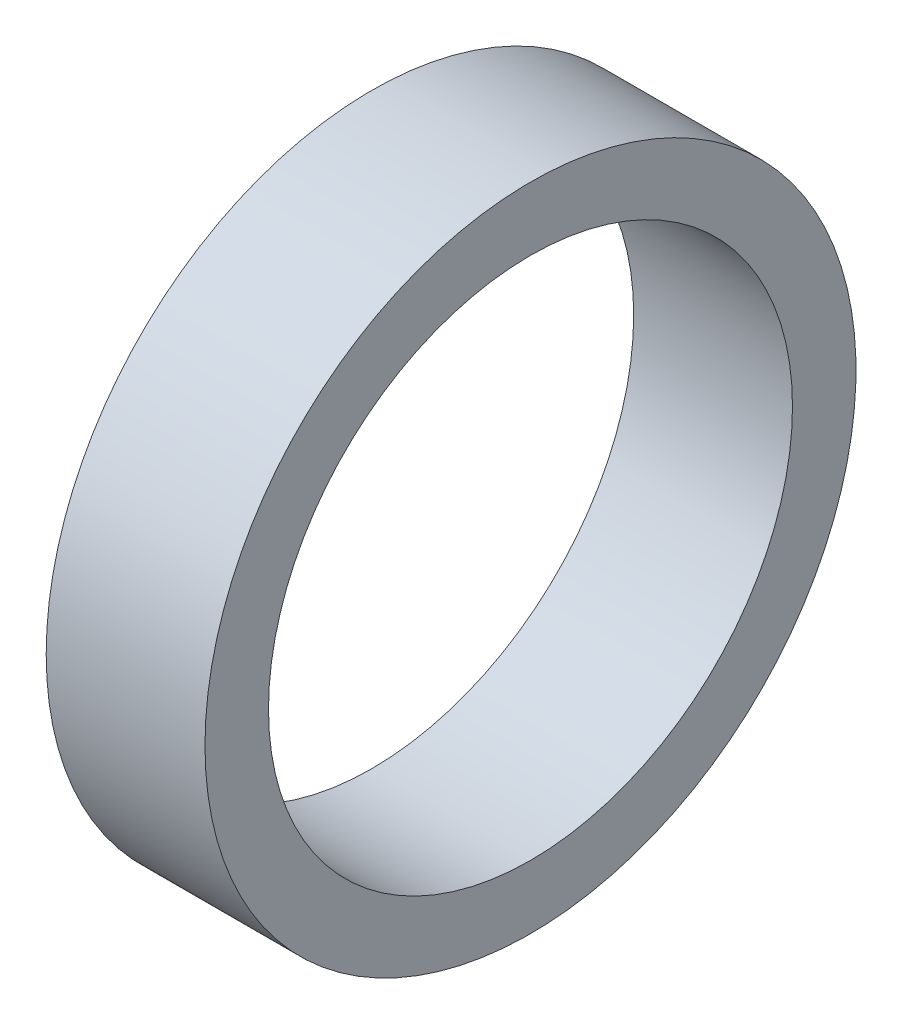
ISO-10303-21;
HEADER;
FILE_DESCRIPTION(('STEP AP214'),'2;1');
FILE_NAME('part.step','',(''),(''),'','','');
FILE_SCHEMA(('AUTOMOTIVE_DESIGN { 1 0 10303 214 1 1 1 1 }'));
ENDSEC;
DATA;
#1=APPLICATION_CONTEXT('core data for automotive mechanical design processes');
#2=APPLICATION_PROTOCOL_DEFINITION('international standard','automotive_design',2000,#1);
#3=PRODUCT_CONTEXT('',#1,'mechanical');
#4=PRODUCT('Part','Part','',(#3));
#5=PRODUCT_RELATED_PRODUCT_CATEGORY('part','',(#4));
#6=PRODUCT_DEFINITION_FORMATION('','',#4);
#7=PRODUCT_DEFINITION_CONTEXT('part definition',#1,'design');
#8=PRODUCT_DEFINITION('design','',#6,#7);
#9=PRODUCT_DEFINITION_SHAPE('','',#8);
#10=(LENGTH_UNIT() NAMED_UNIT(*) SI_UNIT(.MILLI.,.METRE.));
#11=(NAMED_UNIT(*) PLANE_ANGLE_UNIT() SI_UNIT($,.RADIAN.));
#12=(NAMED_UNIT(*) SI_UNIT($,.STERADIAN.) SOLID_ANGLE_UNIT());
#13=UNCERTAINTY_MEASURE_WITH_UNIT(LENGTH_MEASURE(1.E-05),#10,'distance_accuracy_value','');
#14=(GEOMETRIC_REPRESENTATION_CONTEXT(3) GLOBAL_UNCERTAINTY_ASSIGNED_CONTEXT((#13)) GLOBAL_UNIT_ASSIGNED_CONTEXT((#10,
#11,#12)) REPRESENTATION_CONTEXT('',''));
#15=CARTESIAN_POINT('',(0.,0.,0.));
#16=DIRECTION('',(0.,0.,1.));
#17=DIRECTION('',(1.,0.,0.));
#18=AXIS2_PLACEMENT_3D('',#15,#16,#17);
#19=CARTESIAN_POINT('',(-5.,20.5,0.));
#20=DIRECTION('',(1.,0.,0.));
#21=DIRECTION('',(0.,0.,-1.));
#22=AXIS2_PLACEMENT_3D('',#19,#20,#21);
#23=PLANE('',#22);
#24=CARTESIAN_POINT('',(-5.,0.,0.));
#25=DIRECTION('',(-1.,0.,0.));
#26=DIRECTION('',(0.,0.,1.));
#27=AXIS2_PLACEMENT_3D('',#24,#25,#26);
#28=CIRCLE('',#27,16.5);
#29=CARTESIAN_POINT('',(-5.,0.,16.5));
#30=VERTEX_POINT('',#29);
#31=EDGE_CURVE('E10',#30,#30,#28,.T.);
#32=ORIENTED_EDGE('',*,*,#31,.F.);
#33=EDGE_LOOP('',(#32));
#34=FACE_BOUND('',#33,.T.);
#35=CARTESIAN_POINT('',(-5.,0.,0.));
#36=DIRECTION('',(-1.,0.,0.));
#37=DIRECTION('',(0.,0.,1.));
#38=AXIS2_PLACEMENT_3D('',#35,#36,#37);
#39=CIRCLE('',#38,20.5);
#40=CARTESIAN_POINT('',(-5.,0.,20.5));
#41=VERTEX_POINT('',#40);
#42=EDGE_CURVE('E43',#41,#41,#39,.T.);
#43=ORIENTED_EDGE('',*,*,#42,.T.);
#44=EDGE_LOOP('',(#43));
#45=FACE_BOUND('',#44,.T.);
#46=ADVANCED_FACE('F29',(#34,#45),#23,.F.);
#47=CARTESIAN_POINT('',(-14.9039741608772,0.,0.));
#48=DIRECTION('',(-1.,0.,0.));
#49=DIRECTION('',(0.,0.,1.));
#50=AXIS2_PLACEMENT_3D('',#47,#48,#49);
#51=CYLINDRICAL_SURFACE('',#50,16.5);
#52=CARTESIAN_POINT('',(5.,0.,0.));
#53=DIRECTION('',(-1.,0.,0.));
#54=DIRECTION('',(0.,0.,1.));
#55=AXIS2_PLACEMENT_3D('',#52,#53,#54);
#56=CIRCLE('',#55,16.5);
#57=CARTESIAN_POINT('',(5.,0.,16.5));
#58=VERTEX_POINT('',#57);
#59=EDGE_CURVE('E35',#58,#58,#56,.T.);
#60=ORIENTED_EDGE('',*,*,#59,.F.);
#61=EDGE_LOOP('',(#60));
#62=FACE_BOUND('',#61,.T.);
#63=ORIENTED_EDGE('',*,*,#31,.T.);
#64=EDGE_LOOP('',(#63));
#65=FACE_BOUND('',#64,.T.);
#66=ADVANCED_FACE('F58',(#62,#65),#51,.F.);
#67=CARTESIAN_POINT('',(5.,20.5,0.));
#68=DIRECTION('',(-1.,0.,0.));
#69=DIRECTION('',(0.,0.,1.));
#70=AXIS2_PLACEMENT_3D('',#67,#68,#69);
#71=PLANE('',#70);
#72=CARTESIAN_POINT('',(5.,0.,0.));
#73=DIRECTION('',(-1.,0.,0.));
#74=DIRECTION('',(0.,0.,1.));
#75=AXIS2_PLACEMENT_3D('',#72,#73,#74);
#76=CIRCLE('',#75,20.5);
#77=CARTESIAN_POINT('',(5.,0.,20.5));
#78=VERTEX_POINT('',#77);
#79=EDGE_CURVE('E39',#78,#78,#76,.T.);
#80=ORIENTED_EDGE('',*,*,#79,.F.);
#81=EDGE_LOOP('',(#80));
#82=FACE_BOUND('',#81,.T.);
#83=ORIENTED_EDGE('',*,*,#59,.T.);
#84=EDGE_LOOP('',(#83));
#85=FACE_BOUND('',#84,.T.);
#86=ADVANCED_FACE('F53',(#82,#85),#71,.F.);
#87=CARTESIAN_POINT('',(-14.9039741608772,0.,0.));
#88=DIRECTION('',(-1.,0.,0.));
#89=DIRECTION('',(0.,0.,1.));
#90=AXIS2_PLACEMENT_3D('',#87,#88,#89);
#91=CYLINDRICAL_SURFACE('',#90,20.5);
#92=ORIENTED_EDGE('',*,*,#42,.F.);
#93=EDGE_LOOP('',(#92));
#94=FACE_BOUND('',#93,.T.);
#95=ORIENTED_EDGE('',*,*,#79,.T.);
#96=EDGE_LOOP('',(#95));
#97=FACE_BOUND('',#96,.T.);
#98=ADVANCED_FACE('F50',(#94,#97),#91,.T.);
#99=CLOSED_SHELL('',(#46,#66,#86,#98));
#100=MANIFOLD_SOLID_BREP('B2',#99);
#101=ADVANCED_BREP_SHAPE_REPRESENTATION('',(#18,#100),#14);
#102=SHAPE_DEFINITION_REPRESENTATION(#9,#101);
ENDSEC;
END-ISO-10303-21;
